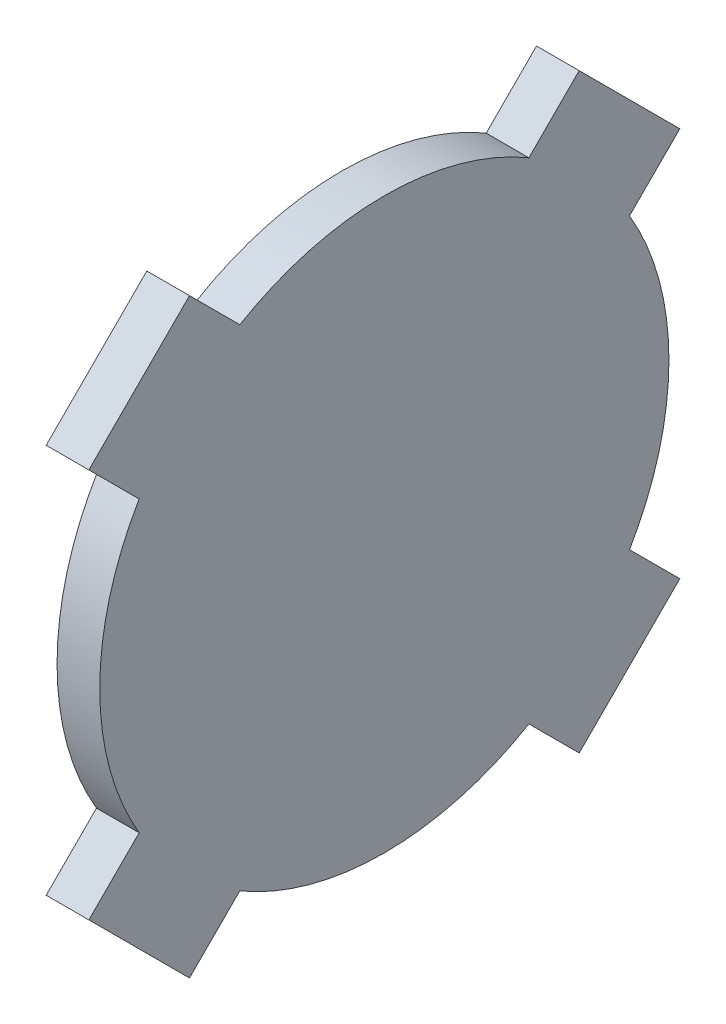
ISO-10303-21;
HEADER;
FILE_DESCRIPTION(('STEP AP214'),'2;1');
FILE_NAME('part.step','',(''),(''),'','','');
FILE_SCHEMA(('AUTOMOTIVE_DESIGN { 1 0 10303 214 1 1 1 1 }'));
ENDSEC;
DATA;
#1=APPLICATION_CONTEXT('core data for automotive mechanical design processes');
#2=APPLICATION_PROTOCOL_DEFINITION('international standard','automotive_design',2000,#1);
#3=PRODUCT_CONTEXT('',#1,'mechanical');
#4=PRODUCT('Part','Part','',(#3));
#5=PRODUCT_RELATED_PRODUCT_CATEGORY('part','',(#4));
#6=PRODUCT_DEFINITION_FORMATION('','',#4);
#7=PRODUCT_DEFINITION_CONTEXT('part definition',#1,'design');
#8=PRODUCT_DEFINITION('design','',#6,#7);
#9=PRODUCT_DEFINITION_SHAPE('','',#8);
#10=(LENGTH_UNIT() NAMED_UNIT(*) SI_UNIT(.MILLI.,.METRE.));
#11=(NAMED_UNIT(*) PLANE_ANGLE_UNIT() SI_UNIT($,.RADIAN.));
#12=(NAMED_UNIT(*) SI_UNIT($,.STERADIAN.) SOLID_ANGLE_UNIT());
#13=UNCERTAINTY_MEASURE_WITH_UNIT(LENGTH_MEASURE(1.E-05),#10,'distance_accuracy_value','');
#14=(GEOMETRIC_REPRESENTATION_CONTEXT(3) GLOBAL_UNCERTAINTY_ASSIGNED_CONTEXT((#13)) GLOBAL_UNIT_ASSIGNED_CONTEXT((#10,
#11,#12)) REPRESENTATION_CONTEXT('',''));
#15=CARTESIAN_POINT('',(0.,0.,0.));
#16=DIRECTION('',(0.,0.,1.));
#17=DIRECTION('',(1.,0.,0.));
#18=AXIS2_PLACEMENT_3D('',#15,#16,#17);
#19=CARTESIAN_POINT('',(3.,-16.8442054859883,-51.188331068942));
#20=DIRECTION('',(-1.,0.,0.));
#21=DIRECTION('',(0.,0.,1.));
#22=AXIS2_PLACEMENT_3D('',#19,#20,#21);
#23=CYLINDRICAL_SURFACE('',#22,20.);
#24=CARTESIAN_POINT('',(0.,-16.8442054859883,-51.188331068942));
#25=DIRECTION('',(1.,0.,0.));
#26=DIRECTION('',(0.,0.,-1.));
#27=AXIS2_PLACEMENT_3D('',#24,#25,#26);
#28=CIRCLE('',#27,20.);
#29=CARTESIAN_POINT('',(0.,-27.0017355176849,-68.4169289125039));
#30=VERTEX_POINT('',#29);
#31=CARTESIAN_POINT('',(0.,-6.68667545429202,-68.416928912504));
#32=VERTEX_POINT('',#31);
#33=EDGE_CURVE('E177',#30,#32,#28,.T.);
#34=ORIENTED_EDGE('',*,*,#33,.T.);
#35=DIRECTION('',(-1.,0.,0.));
#36=VECTOR('',#35,1.);
#37=CARTESIAN_POINT('',(3.,-6.68667545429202,-68.416928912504));
#38=LINE('',#37,#36);
#39=CARTESIAN_POINT('',(3.,-6.68667545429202,-68.416928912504));
#40=VERTEX_POINT('',#39);
#41=EDGE_CURVE('E11',#40,#32,#38,.T.);
#42=ORIENTED_EDGE('',*,*,#41,.F.);
#43=CARTESIAN_POINT('',(3.,-16.8442054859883,-51.188331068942));
#44=DIRECTION('',(1.,0.,0.));
#45=DIRECTION('',(0.,0.,-1.));
#46=AXIS2_PLACEMENT_3D('',#43,#44,#45);
#47=CIRCLE('',#46,20.);
#48=CARTESIAN_POINT('',(3.,-27.0017355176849,-68.4169289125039));
#49=VERTEX_POINT('',#48);
#50=EDGE_CURVE('E207',#49,#40,#47,.T.);
#51=ORIENTED_EDGE('',*,*,#50,.F.);
#52=DIRECTION('',(-1.,0.,0.));
#53=VECTOR('',#52,1.);
#54=CARTESIAN_POINT('',(3.,-27.0017355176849,-68.4169289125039));
#55=LINE('',#54,#53);
#56=EDGE_CURVE('E173',#49,#30,#55,.T.);
#57=ORIENTED_EDGE('',*,*,#56,.T.);
#58=EDGE_LOOP('',(#34,#42,#51,#57));
#59=FACE_BOUND('',#58,.T.);
#60=ADVANCED_FACE('F33',(#59),#23,.T.);
#61=CARTESIAN_POINT('',(3.,-6.68667545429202,-68.416928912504));
#62=DIRECTION('',(0.,0.707106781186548,0.707106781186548));
#63=DIRECTION('',(0.,-0.707106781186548,0.707106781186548));
#64=AXIS2_PLACEMENT_3D('',#61,#62,#63);
#65=PLANE('',#64);
#66=DIRECTION('',(0.,0.707106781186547,-0.707106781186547));
#67=VECTOR('',#66,1.);
#68=CARTESIAN_POINT('',(0.,-6.68667545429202,-68.416928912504));
#69=LINE('',#68,#67);
#70=CARTESIAN_POINT('',(0.,-3.15114154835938,-71.9524628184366));
#71=VERTEX_POINT('',#70);
#72=EDGE_CURVE('E180',#32,#71,#69,.T.);
#73=ORIENTED_EDGE('',*,*,#72,.T.);
#74=DIRECTION('',(-1.,0.,0.));
#75=VECTOR('',#74,1.);
#76=CARTESIAN_POINT('',(3.,-3.15114154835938,-71.9524628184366));
#77=LINE('',#76,#75);
#78=CARTESIAN_POINT('',(3.,-3.15114154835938,-71.9524628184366));
#79=VERTEX_POINT('',#78);
#80=EDGE_CURVE('E41',#79,#71,#77,.T.);
#81=ORIENTED_EDGE('',*,*,#80,.F.);
#82=DIRECTION('',(0.,0.707106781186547,-0.707106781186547));
#83=VECTOR('',#82,1.);
#84=CARTESIAN_POINT('',(3.,-6.68667545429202,-68.416928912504));
#85=LINE('',#84,#83);
#86=EDGE_CURVE('E116',#40,#79,#85,.T.);
#87=ORIENTED_EDGE('',*,*,#86,.F.);
#88=ORIENTED_EDGE('',*,*,#41,.T.);
#89=EDGE_LOOP('',(#73,#81,#87,#88));
#90=FACE_BOUND('',#89,.T.);
#91=ADVANCED_FACE('F305',(#90),#65,.F.);
#92=CARTESIAN_POINT('',(3.,3.91992626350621,-64.8813950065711));
#93=DIRECTION('',(0.,-0.707106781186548,0.707106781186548));
#94=DIRECTION('',(0.,-0.707106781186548,-0.707106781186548));
#95=AXIS2_PLACEMENT_3D('',#92,#93,#94);
#96=PLANE('',#95);
#97=DIRECTION('',(0.,0.707106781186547,0.707106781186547));
#98=VECTOR('',#97,1.);
#99=CARTESIAN_POINT('',(0.,3.91992626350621,-64.8813950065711));
#100=LINE('',#99,#98);
#101=CARTESIAN_POINT('',(0.,3.91992626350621,-64.8813950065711));
#102=VERTEX_POINT('',#101);
#103=EDGE_CURVE('E182',#71,#102,#100,.T.);
#104=ORIENTED_EDGE('',*,*,#103,.T.);
#105=DIRECTION('',(-1.,0.,0.));
#106=VECTOR('',#105,1.);
#107=CARTESIAN_POINT('',(3.,3.91992626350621,-64.8813950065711));
#108=LINE('',#107,#106);
#109=CARTESIAN_POINT('',(3.,3.91992626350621,-64.8813950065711));
#110=VERTEX_POINT('',#109);
#111=EDGE_CURVE('E238',#110,#102,#108,.T.);
#112=ORIENTED_EDGE('',*,*,#111,.F.);
#113=DIRECTION('',(0.,0.707106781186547,0.707106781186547));
#114=VECTOR('',#113,1.);
#115=CARTESIAN_POINT('',(3.,3.91992626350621,-64.8813950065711));
#116=LINE('',#115,#114);
#117=EDGE_CURVE('E246',#79,#110,#116,.T.);
#118=ORIENTED_EDGE('',*,*,#117,.F.);
#119=ORIENTED_EDGE('',*,*,#80,.T.);
#120=EDGE_LOOP('',(#104,#112,#118,#119));
#121=FACE_BOUND('',#120,.T.);
#122=ADVANCED_FACE('F244',(#121),#96,.F.);
#123=CARTESIAN_POINT('',(3.,3.91992626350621,-64.8813950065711));
#124=DIRECTION('',(0.,-0.707106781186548,-0.707106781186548));
#125=DIRECTION('',(0.,0.707106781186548,-0.707106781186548));
#126=AXIS2_PLACEMENT_3D('',#123,#124,#125);
#127=PLANE('',#126);
#128=DIRECTION('',(0.,-0.707106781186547,0.707106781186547));
#129=VECTOR('',#128,1.);
#130=CARTESIAN_POINT('',(0.,3.91992626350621,-64.8813950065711));
#131=LINE('',#130,#129);
#132=CARTESIAN_POINT('',(0.,0.384392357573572,-61.3458611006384));
#133=VERTEX_POINT('',#132);
#134=EDGE_CURVE('E184',#102,#133,#131,.T.);
#135=ORIENTED_EDGE('',*,*,#134,.T.);
#136=DIRECTION('',(-1.,0.,0.));
#137=VECTOR('',#136,1.);
#138=CARTESIAN_POINT('',(3.,0.384392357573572,-61.3458611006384));
#139=LINE('',#138,#137);
#140=CARTESIAN_POINT('',(3.,0.384392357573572,-61.3458611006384));
#141=VERTEX_POINT('',#140);
#142=EDGE_CURVE('E235',#141,#133,#139,.T.);
#143=ORIENTED_EDGE('',*,*,#142,.F.);
#144=DIRECTION('',(0.,-0.707106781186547,0.707106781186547));
#145=VECTOR('',#144,1.);
#146=CARTESIAN_POINT('',(3.,3.91992626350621,-64.8813950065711));
#147=LINE('',#146,#145);
#148=EDGE_CURVE('E264',#110,#141,#147,.T.);
#149=ORIENTED_EDGE('',*,*,#148,.F.);
#150=ORIENTED_EDGE('',*,*,#111,.T.);
#151=EDGE_LOOP('',(#135,#143,#149,#150));
#152=FACE_BOUND('',#151,.T.);
#153=ADVANCED_FACE('F255',(#152),#127,.F.);
#154=CARTESIAN_POINT('',(3.,-16.8442054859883,-51.188331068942));
#155=DIRECTION('',(-1.,0.,0.));
#156=DIRECTION('',(0.,0.,1.));
#157=AXIS2_PLACEMENT_3D('',#154,#155,#156);
#158=CYLINDRICAL_SURFACE('',#157,20.);
#159=CARTESIAN_POINT('',(0.,-16.8442054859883,-51.188331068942));
#160=DIRECTION('',(1.,0.,0.));
#161=DIRECTION('',(0.,0.,-1.));
#162=AXIS2_PLACEMENT_3D('',#159,#160,#161);
#163=CIRCLE('',#162,20.);
#164=CARTESIAN_POINT('',(0.,0.384392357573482,-41.0308010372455));
#165=VERTEX_POINT('',#164);
#166=EDGE_CURVE('E186',#133,#165,#163,.T.);
#167=ORIENTED_EDGE('',*,*,#166,.T.);
#168=DIRECTION('',(-1.,0.,0.));
#169=VECTOR('',#168,1.);
#170=CARTESIAN_POINT('',(3.,0.384392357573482,-41.0308010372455));
#171=LINE('',#170,#169);
#172=CARTESIAN_POINT('',(3.,0.384392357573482,-41.0308010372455));
#173=VERTEX_POINT('',#172);
#174=EDGE_CURVE('E232',#173,#165,#171,.T.);
#175=ORIENTED_EDGE('',*,*,#174,.F.);
#176=CARTESIAN_POINT('',(3.,-16.8442054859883,-51.188331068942));
#177=DIRECTION('',(1.,0.,0.));
#178=DIRECTION('',(0.,0.,-1.));
#179=AXIS2_PLACEMENT_3D('',#176,#177,#178);
#180=CIRCLE('',#179,20.);
#181=EDGE_CURVE('E261',#141,#173,#180,.T.);
#182=ORIENTED_EDGE('',*,*,#181,.F.);
#183=ORIENTED_EDGE('',*,*,#142,.T.);
#184=EDGE_LOOP('',(#167,#175,#182,#183));
#185=FACE_BOUND('',#184,.T.);
#186=ADVANCED_FACE('F259',(#185),#158,.T.);
#187=CARTESIAN_POINT('',(3.,0.384392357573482,-41.0308010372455));
#188=DIRECTION('',(0.,-0.707106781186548,0.707106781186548));
#189=DIRECTION('',(0.,-0.707106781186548,-0.707106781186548));
#190=AXIS2_PLACEMENT_3D('',#187,#188,#189);
#191=PLANE('',#190);
#192=DIRECTION('',(0.,0.707106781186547,0.707106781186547));
#193=VECTOR('',#192,1.);
#194=CARTESIAN_POINT('',(0.,0.384392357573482,-41.0308010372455));
#195=LINE('',#194,#193);
#196=CARTESIAN_POINT('',(0.,3.91992626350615,-37.4952671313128));
#197=VERTEX_POINT('',#196);
#198=EDGE_CURVE('E188',#165,#197,#195,.T.);
#199=ORIENTED_EDGE('',*,*,#198,.T.);
#200=DIRECTION('',(-1.,0.,0.));
#201=VECTOR('',#200,1.);
#202=CARTESIAN_POINT('',(3.,3.91992626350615,-37.4952671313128));
#203=LINE('',#202,#201);
#204=CARTESIAN_POINT('',(3.,3.91992626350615,-37.4952671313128));
#205=VERTEX_POINT('',#204);
#206=EDGE_CURVE('E229',#205,#197,#203,.T.);
#207=ORIENTED_EDGE('',*,*,#206,.F.);
#208=DIRECTION('',(0.,0.707106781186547,0.707106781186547));
#209=VECTOR('',#208,1.);
#210=CARTESIAN_POINT('',(3.,0.384392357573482,-41.0308010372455));
#211=LINE('',#210,#209);
#212=EDGE_CURVE('E263',#173,#205,#211,.T.);
#213=ORIENTED_EDGE('',*,*,#212,.F.);
#214=ORIENTED_EDGE('',*,*,#174,.T.);
#215=EDGE_LOOP('',(#199,#207,#213,#214));
#216=FACE_BOUND('',#215,.T.);
#217=ADVANCED_FACE('F318',(#216),#191,.F.);
#218=CARTESIAN_POINT('',(3.,-3.15114154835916,-30.4241993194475));
#219=DIRECTION('',(0.,-0.707106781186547,-0.707106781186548));
#220=DIRECTION('',(0.,0.707106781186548,-0.707106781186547));
#221=AXIS2_PLACEMENT_3D('',#218,#219,#220);
#222=PLANE('',#221);
#223=DIRECTION('',(0.,-0.707106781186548,0.707106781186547));
#224=VECTOR('',#223,1.);
#225=CARTESIAN_POINT('',(0.,-3.15114154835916,-30.4241993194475));
#226=LINE('',#225,#224);
#227=CARTESIAN_POINT('',(0.,-3.15114154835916,-30.4241993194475));
#228=VERTEX_POINT('',#227);
#229=EDGE_CURVE('E190',#197,#228,#226,.T.);
#230=ORIENTED_EDGE('',*,*,#229,.T.);
#231=DIRECTION('',(-1.,0.,0.));
#232=VECTOR('',#231,1.);
#233=CARTESIAN_POINT('',(3.,-3.15114154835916,-30.4241993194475));
#234=LINE('',#233,#232);
#235=CARTESIAN_POINT('',(3.,-3.15114154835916,-30.4241993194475));
#236=VERTEX_POINT('',#235);
#237=EDGE_CURVE('E226',#236,#228,#234,.T.);
#238=ORIENTED_EDGE('',*,*,#237,.F.);
#239=DIRECTION('',(0.,-0.707106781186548,0.707106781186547));
#240=VECTOR('',#239,1.);
#241=CARTESIAN_POINT('',(3.,-3.15114154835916,-30.4241993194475));
#242=LINE('',#241,#240);
#243=EDGE_CURVE('E266',#205,#236,#242,.T.);
#244=ORIENTED_EDGE('',*,*,#243,.F.);
#245=ORIENTED_EDGE('',*,*,#206,.T.);
#246=EDGE_LOOP('',(#230,#238,#244,#245));
#247=FACE_BOUND('',#246,.T.);
#248=ADVANCED_FACE('F321',(#247),#222,.F.);
#249=CARTESIAN_POINT('',(3.,-3.15114154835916,-30.4241993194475));
#250=DIRECTION('',(0.,0.707106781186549,-0.707106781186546));
#251=DIRECTION('',(0.,0.707106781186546,0.707106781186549));
#252=AXIS2_PLACEMENT_3D('',#249,#250,#251);
#253=PLANE('',#252);
#254=DIRECTION('',(0.,-0.707106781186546,-0.707106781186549));
#255=VECTOR('',#254,1.);
#256=CARTESIAN_POINT('',(0.,-3.15114154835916,-30.4241993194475));
#257=LINE('',#256,#255);
#258=CARTESIAN_POINT('',(0.,-6.68667545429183,-33.9597332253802));
#259=VERTEX_POINT('',#258);
#260=EDGE_CURVE('E192',#228,#259,#257,.T.);
#261=ORIENTED_EDGE('',*,*,#260,.T.);
#262=DIRECTION('',(-1.,0.,0.));
#263=VECTOR('',#262,1.);
#264=CARTESIAN_POINT('',(3.,-6.68667545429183,-33.9597332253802));
#265=LINE('',#264,#263);
#266=CARTESIAN_POINT('',(3.,-6.68667545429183,-33.9597332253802));
#267=VERTEX_POINT('',#266);
#268=EDGE_CURVE('E223',#267,#259,#265,.T.);
#269=ORIENTED_EDGE('',*,*,#268,.F.);
#270=DIRECTION('',(0.,-0.707106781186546,-0.707106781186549));
#271=VECTOR('',#270,1.);
#272=CARTESIAN_POINT('',(3.,-3.15114154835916,-30.4241993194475));
#273=LINE('',#272,#271);
#274=EDGE_CURVE('E272',#236,#267,#273,.T.);
#275=ORIENTED_EDGE('',*,*,#274,.F.);
#276=ORIENTED_EDGE('',*,*,#237,.T.);
#277=EDGE_LOOP('',(#261,#269,#275,#276));
#278=FACE_BOUND('',#277,.T.);
#279=ADVANCED_FACE('F325',(#278),#253,.F.);
#280=CARTESIAN_POINT('',(3.,-16.8442054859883,-51.188331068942));
#281=DIRECTION('',(-1.,0.,0.));
#282=DIRECTION('',(0.,0.,1.));
#283=AXIS2_PLACEMENT_3D('',#280,#281,#282);
#284=CYLINDRICAL_SURFACE('',#283,20.);
#285=CARTESIAN_POINT('',(0.,-16.8442054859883,-51.188331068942));
#286=DIRECTION('',(1.,0.,0.));
#287=DIRECTION('',(0.,0.,-1.));
#288=AXIS2_PLACEMENT_3D('',#285,#286,#287);
#289=CIRCLE('',#288,20.);
#290=CARTESIAN_POINT('',(0.,-27.0017355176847,-33.9597332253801));
#291=VERTEX_POINT('',#290);
#292=EDGE_CURVE('E194',#259,#291,#289,.T.);
#293=ORIENTED_EDGE('',*,*,#292,.T.);
#294=DIRECTION('',(-1.,0.,0.));
#295=VECTOR('',#294,1.);
#296=CARTESIAN_POINT('',(3.,-27.0017355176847,-33.9597332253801));
#297=LINE('',#296,#295);
#298=CARTESIAN_POINT('',(3.,-27.0017355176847,-33.9597332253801));
#299=VERTEX_POINT('',#298);
#300=EDGE_CURVE('E220',#299,#291,#297,.T.);
#301=ORIENTED_EDGE('',*,*,#300,.F.);
#302=CARTESIAN_POINT('',(3.,-16.8442054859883,-51.188331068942));
#303=DIRECTION('',(1.,0.,0.));
#304=DIRECTION('',(0.,0.,-1.));
#305=AXIS2_PLACEMENT_3D('',#302,#303,#304);
#306=CIRCLE('',#305,20.);
#307=EDGE_CURVE('E274',#267,#299,#306,.T.);
#308=ORIENTED_EDGE('',*,*,#307,.F.);
#309=ORIENTED_EDGE('',*,*,#268,.T.);
#310=EDGE_LOOP('',(#293,#301,#308,#309));
#311=FACE_BOUND('',#310,.T.);
#312=ADVANCED_FACE('F329',(#311),#284,.T.);
#313=CARTESIAN_POINT('',(3.,-27.0017355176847,-33.9597332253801));
#314=DIRECTION('',(0.,-0.707106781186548,-0.707106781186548));
#315=DIRECTION('',(0.,0.707106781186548,-0.707106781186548));
#316=AXIS2_PLACEMENT_3D('',#313,#314,#315);
#317=PLANE('',#316);
#318=DIRECTION('',(0.,-0.707106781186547,0.707106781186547));
#319=VECTOR('',#318,1.);
#320=CARTESIAN_POINT('',(0.,-27.0017355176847,-33.9597332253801));
#321=LINE('',#320,#319);
#322=CARTESIAN_POINT('',(0.,-30.5372694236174,-30.4241993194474));
#323=VERTEX_POINT('',#322);
#324=EDGE_CURVE('E196',#291,#323,#321,.T.);
#325=ORIENTED_EDGE('',*,*,#324,.T.);
#326=DIRECTION('',(-1.,0.,0.));
#327=VECTOR('',#326,1.);
#328=CARTESIAN_POINT('',(3.,-30.5372694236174,-30.4241993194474));
#329=LINE('',#328,#327);
#330=CARTESIAN_POINT('',(3.,-30.5372694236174,-30.4241993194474));
#331=VERTEX_POINT('',#330);
#332=EDGE_CURVE('E217',#331,#323,#329,.T.);
#333=ORIENTED_EDGE('',*,*,#332,.F.);
#334=DIRECTION('',(0.,-0.707106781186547,0.707106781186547));
#335=VECTOR('',#334,1.);
#336=CARTESIAN_POINT('',(3.,-27.0017355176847,-33.9597332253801));
#337=LINE('',#336,#335);
#338=EDGE_CURVE('E276',#299,#331,#337,.T.);
#339=ORIENTED_EDGE('',*,*,#338,.F.);
#340=ORIENTED_EDGE('',*,*,#300,.T.);
#341=EDGE_LOOP('',(#325,#333,#339,#340));
#342=FACE_BOUND('',#341,.T.);
#343=ADVANCED_FACE('F333',(#342),#317,.F.);
#344=CARTESIAN_POINT('',(3.,-37.608337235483,-37.495267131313));
#345=DIRECTION('',(0.,0.707106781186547,-0.707106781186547));
#346=DIRECTION('',(0.,0.707106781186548,0.707106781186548));
#347=AXIS2_PLACEMENT_3D('',#344,#345,#346);
#348=PLANE('',#347);
#349=DIRECTION('',(0.,-0.707106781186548,-0.707106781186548));
#350=VECTOR('',#349,1.);
#351=CARTESIAN_POINT('',(0.,-37.608337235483,-37.495267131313));
#352=LINE('',#351,#350);
#353=CARTESIAN_POINT('',(0.,-37.608337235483,-37.495267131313));
#354=VERTEX_POINT('',#353);
#355=EDGE_CURVE('E198',#323,#354,#352,.T.);
#356=ORIENTED_EDGE('',*,*,#355,.T.);
#357=DIRECTION('',(-1.,0.,0.));
#358=VECTOR('',#357,1.);
#359=CARTESIAN_POINT('',(3.,-37.608337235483,-37.495267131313));
#360=LINE('',#359,#358);
#361=CARTESIAN_POINT('',(3.,-37.608337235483,-37.495267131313));
#362=VERTEX_POINT('',#361);
#363=EDGE_CURVE('E214',#362,#354,#360,.T.);
#364=ORIENTED_EDGE('',*,*,#363,.F.);
#365=DIRECTION('',(0.,-0.707106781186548,-0.707106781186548));
#366=VECTOR('',#365,1.);
#367=CARTESIAN_POINT('',(3.,-37.608337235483,-37.495267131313));
#368=LINE('',#367,#366);
#369=EDGE_CURVE('E278',#331,#362,#368,.T.);
#370=ORIENTED_EDGE('',*,*,#369,.F.);
#371=ORIENTED_EDGE('',*,*,#332,.T.);
#372=EDGE_LOOP('',(#356,#364,#370,#371));
#373=FACE_BOUND('',#372,.T.);
#374=ADVANCED_FACE('F337',(#373),#348,.F.);
#375=CARTESIAN_POINT('',(3.,-37.608337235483,-37.495267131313));
#376=DIRECTION('',(0.,0.707106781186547,0.707106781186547));
#377=DIRECTION('',(0.,-0.707106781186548,0.707106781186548));
#378=AXIS2_PLACEMENT_3D('',#375,#376,#377);
#379=PLANE('',#378);
#380=DIRECTION('',(0.,0.707106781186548,-0.707106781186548));
#381=VECTOR('',#380,1.);
#382=CARTESIAN_POINT('',(0.,-37.608337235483,-37.495267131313));
#383=LINE('',#382,#381);
#384=CARTESIAN_POINT('',(0.,-34.0728033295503,-41.0308010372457));
#385=VERTEX_POINT('',#384);
#386=EDGE_CURVE('E200',#354,#385,#383,.T.);
#387=ORIENTED_EDGE('',*,*,#386,.T.);
#388=DIRECTION('',(-1.,0.,0.));
#389=VECTOR('',#388,1.);
#390=CARTESIAN_POINT('',(3.,-34.0728033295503,-41.0308010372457));
#391=LINE('',#390,#389);
#392=CARTESIAN_POINT('',(3.,-34.0728033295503,-41.0308010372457));
#393=VERTEX_POINT('',#392);
#394=EDGE_CURVE('E211',#393,#385,#391,.T.);
#395=ORIENTED_EDGE('',*,*,#394,.F.);
#396=DIRECTION('',(0.,0.707106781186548,-0.707106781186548));
#397=VECTOR('',#396,1.);
#398=CARTESIAN_POINT('',(3.,-37.608337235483,-37.495267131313));
#399=LINE('',#398,#397);
#400=EDGE_CURVE('E280',#362,#393,#399,.T.);
#401=ORIENTED_EDGE('',*,*,#400,.F.);
#402=ORIENTED_EDGE('',*,*,#363,.T.);
#403=EDGE_LOOP('',(#387,#395,#401,#402));
#404=FACE_BOUND('',#403,.T.);
#405=ADVANCED_FACE('F286',(#404),#379,.F.);
#406=CARTESIAN_POINT('',(3.,-16.8442054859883,-51.188331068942));
#407=DIRECTION('',(-1.,0.,0.));
#408=DIRECTION('',(0.,0.,1.));
#409=AXIS2_PLACEMENT_3D('',#406,#407,#408);
#410=CYLINDRICAL_SURFACE('',#409,20.);
#411=CARTESIAN_POINT('',(0.,-16.8442054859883,-51.188331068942));
#412=DIRECTION('',(1.,0.,0.));
#413=DIRECTION('',(0.,0.,-1.));
#414=AXIS2_PLACEMENT_3D('',#411,#412,#413);
#415=CIRCLE('',#414,20.);
#416=CARTESIAN_POINT('',(0.,-34.0728033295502,-61.3458611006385));
#417=VERTEX_POINT('',#416);
#418=EDGE_CURVE('E202',#385,#417,#415,.T.);
#419=ORIENTED_EDGE('',*,*,#418,.T.);
#420=DIRECTION('',(-1.,0.,0.));
#421=VECTOR('',#420,1.);
#422=CARTESIAN_POINT('',(3.,-34.0728033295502,-61.3458611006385));
#423=LINE('',#422,#421);
#424=CARTESIAN_POINT('',(3.,-34.0728033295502,-61.3458611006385));
#425=VERTEX_POINT('',#424);
#426=EDGE_CURVE('E168',#425,#417,#423,.T.);
#427=ORIENTED_EDGE('',*,*,#426,.F.);
#428=CARTESIAN_POINT('',(3.,-16.8442054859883,-51.188331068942));
#429=DIRECTION('',(1.,0.,0.));
#430=DIRECTION('',(0.,0.,-1.));
#431=AXIS2_PLACEMENT_3D('',#428,#429,#430);
#432=CIRCLE('',#431,20.);
#433=EDGE_CURVE('E159',#393,#425,#432,.T.);
#434=ORIENTED_EDGE('',*,*,#433,.F.);
#435=ORIENTED_EDGE('',*,*,#394,.T.);
#436=EDGE_LOOP('',(#419,#427,#434,#435));
#437=FACE_BOUND('',#436,.T.);
#438=ADVANCED_FACE('F290',(#437),#410,.T.);
#439=CARTESIAN_POINT('',(3.,-34.0728033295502,-61.3458611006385));
#440=DIRECTION('',(0.,0.707106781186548,-0.707106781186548));
#441=DIRECTION('',(0.,0.707106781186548,0.707106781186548));
#442=AXIS2_PLACEMENT_3D('',#439,#440,#441);
#443=PLANE('',#442);
#444=DIRECTION('',(0.,-0.707106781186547,-0.707106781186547));
#445=VECTOR('',#444,1.);
#446=CARTESIAN_POINT('',(0.,-34.0728033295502,-61.3458611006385));
#447=LINE('',#446,#445);
#448=CARTESIAN_POINT('',(0.,-37.6083372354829,-64.8813950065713));
#449=VERTEX_POINT('',#448);
#450=EDGE_CURVE('E167',#417,#449,#447,.T.);
#451=ORIENTED_EDGE('',*,*,#450,.T.);
#452=DIRECTION('',(-1.,0.,0.));
#453=VECTOR('',#452,1.);
#454=CARTESIAN_POINT('',(3.,-37.6083372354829,-64.8813950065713));
#455=LINE('',#454,#453);
#456=CARTESIAN_POINT('',(3.,-37.6083372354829,-64.8813950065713));
#457=VERTEX_POINT('',#456);
#458=EDGE_CURVE('E164',#457,#449,#455,.T.);
#459=ORIENTED_EDGE('',*,*,#458,.F.);
#460=DIRECTION('',(0.,-0.707106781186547,-0.707106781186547));
#461=VECTOR('',#460,1.);
#462=CARTESIAN_POINT('',(3.,-34.0728033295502,-61.3458611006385));
#463=LINE('',#462,#461);
#464=EDGE_CURVE('E153',#425,#457,#463,.T.);
#465=ORIENTED_EDGE('',*,*,#464,.F.);
#466=ORIENTED_EDGE('',*,*,#426,.T.);
#467=EDGE_LOOP('',(#451,#459,#465,#466));
#468=FACE_BOUND('',#467,.T.);
#469=ADVANCED_FACE('F165',(#468),#443,.F.);
#470=CARTESIAN_POINT('',(3.,-30.5372694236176,-71.9524628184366));
#471=DIRECTION('',(0.,0.707106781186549,0.707106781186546));
#472=DIRECTION('',(0.,-0.707106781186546,0.707106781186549));
#473=AXIS2_PLACEMENT_3D('',#470,#471,#472);
#474=PLANE('',#473);
#475=DIRECTION('',(0.,0.707106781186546,-0.707106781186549));
#476=VECTOR('',#475,1.);
#477=CARTESIAN_POINT('',(0.,-30.5372694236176,-71.9524628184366));
#478=LINE('',#477,#476);
#479=CARTESIAN_POINT('',(0.,-30.5372694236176,-71.9524628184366));
#480=VERTEX_POINT('',#479);
#481=EDGE_CURVE('E102',#449,#480,#478,.T.);
#482=ORIENTED_EDGE('',*,*,#481,.T.);
#483=DIRECTION('',(-1.,0.,0.));
#484=VECTOR('',#483,1.);
#485=CARTESIAN_POINT('',(3.,-30.5372694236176,-71.9524628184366));
#486=LINE('',#485,#484);
#487=CARTESIAN_POINT('',(3.,-30.5372694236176,-71.9524628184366));
#488=VERTEX_POINT('',#487);
#489=EDGE_CURVE('E169',#488,#480,#486,.T.);
#490=ORIENTED_EDGE('',*,*,#489,.F.);
#491=DIRECTION('',(0.,0.707106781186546,-0.707106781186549));
#492=VECTOR('',#491,1.);
#493=CARTESIAN_POINT('',(3.,-30.5372694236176,-71.9524628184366));
#494=LINE('',#493,#492);
#495=EDGE_CURVE('E157',#457,#488,#494,.T.);
#496=ORIENTED_EDGE('',*,*,#495,.F.);
#497=ORIENTED_EDGE('',*,*,#458,.T.);
#498=EDGE_LOOP('',(#482,#490,#496,#497));
#499=FACE_BOUND('',#498,.T.);
#500=ADVANCED_FACE('F171',(#499),#474,.F.);
#501=CARTESIAN_POINT('',(3.,-30.5372694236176,-71.9524628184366));
#502=DIRECTION('',(0.,-0.707106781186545,0.70710678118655));
#503=DIRECTION('',(0.,-0.70710678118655,-0.707106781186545));
#504=AXIS2_PLACEMENT_3D('',#501,#502,#503);
#505=PLANE('',#504);
#506=DIRECTION('',(0.,0.70710678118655,0.707106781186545));
#507=VECTOR('',#506,1.);
#508=CARTESIAN_POINT('',(0.,-30.5372694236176,-71.9524628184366));
#509=LINE('',#508,#507);
#510=EDGE_CURVE('E108',#480,#30,#509,.T.);
#511=ORIENTED_EDGE('',*,*,#510,.T.);
#512=ORIENTED_EDGE('',*,*,#56,.F.);
#513=DIRECTION('',(0.,0.70710678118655,0.707106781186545));
#514=VECTOR('',#513,1.);
#515=CARTESIAN_POINT('',(3.,-30.5372694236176,-71.9524628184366));
#516=LINE('',#515,#514);
#517=EDGE_CURVE('E49',#488,#49,#516,.T.);
#518=ORIENTED_EDGE('',*,*,#517,.F.);
#519=ORIENTED_EDGE('',*,*,#489,.T.);
#520=EDGE_LOOP('',(#511,#512,#518,#519));
#521=FACE_BOUND('',#520,.T.);
#522=ADVANCED_FACE('F294',(#521),#505,.F.);
#523=CARTESIAN_POINT('',(3.,-16.8442054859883,-51.188331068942));
#524=DIRECTION('',(1.,0.,0.));
#525=DIRECTION('',(0.,0.,-1.));
#526=AXIS2_PLACEMENT_3D('',#523,#524,#525);
#527=PLANE('',#526);
#528=ORIENTED_EDGE('',*,*,#50,.T.);
#529=ORIENTED_EDGE('',*,*,#86,.T.);
#530=ORIENTED_EDGE('',*,*,#117,.T.);
#531=ORIENTED_EDGE('',*,*,#148,.T.);
#532=ORIENTED_EDGE('',*,*,#181,.T.);
#533=ORIENTED_EDGE('',*,*,#212,.T.);
#534=ORIENTED_EDGE('',*,*,#243,.T.);
#535=ORIENTED_EDGE('',*,*,#274,.T.);
#536=ORIENTED_EDGE('',*,*,#307,.T.);
#537=ORIENTED_EDGE('',*,*,#338,.T.);
#538=ORIENTED_EDGE('',*,*,#369,.T.);
#539=ORIENTED_EDGE('',*,*,#400,.T.);
#540=ORIENTED_EDGE('',*,*,#433,.T.);
#541=ORIENTED_EDGE('',*,*,#464,.T.);
#542=ORIENTED_EDGE('',*,*,#495,.T.);
#543=ORIENTED_EDGE('',*,*,#517,.T.);
#544=EDGE_LOOP('',(#528,#529,#530,#531,#532,#533,#534,#535,#536,#537,#538,#539,#540,#541,#542,#543));
#545=FACE_BOUND('',#544,.T.);
#546=ADVANCED_FACE('F155',(#545),#527,.T.);
#547=CARTESIAN_POINT('',(0.,-16.8442054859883,-51.188331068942));
#548=DIRECTION('',(1.,0.,0.));
#549=DIRECTION('',(0.,0.,-1.));
#550=AXIS2_PLACEMENT_3D('',#547,#548,#549);
#551=PLANE('',#550);
#552=ORIENTED_EDGE('',*,*,#33,.F.);
#553=ORIENTED_EDGE('',*,*,#510,.F.);
#554=ORIENTED_EDGE('',*,*,#481,.F.);
#555=ORIENTED_EDGE('',*,*,#450,.F.);
#556=ORIENTED_EDGE('',*,*,#418,.F.);
#557=ORIENTED_EDGE('',*,*,#386,.F.);
#558=ORIENTED_EDGE('',*,*,#355,.F.);
#559=ORIENTED_EDGE('',*,*,#324,.F.);
#560=ORIENTED_EDGE('',*,*,#292,.F.);
#561=ORIENTED_EDGE('',*,*,#260,.F.);
#562=ORIENTED_EDGE('',*,*,#229,.F.);
#563=ORIENTED_EDGE('',*,*,#198,.F.);
#564=ORIENTED_EDGE('',*,*,#166,.F.);
#565=ORIENTED_EDGE('',*,*,#134,.F.);
#566=ORIENTED_EDGE('',*,*,#103,.F.);
#567=ORIENTED_EDGE('',*,*,#72,.F.);
#568=EDGE_LOOP('',(#552,#553,#554,#555,#556,#557,#558,#559,#560,#561,#562,#563,#564,#565,#566,#567));
#569=FACE_BOUND('',#568,.T.);
#570=ADVANCED_FACE('F250',(#569),#551,.F.);
#571=CLOSED_SHELL('',(#60,#91,#122,#153,#186,#217,#248,#279,#312,#343,#374,#405,#438,#469,#500,
#522,#546,#570));
#572=MANIFOLD_SOLID_BREP('B2',#571);
#573=ADVANCED_BREP_SHAPE_REPRESENTATION('',(#18,#572),#14);
#574=SHAPE_DEFINITION_REPRESENTATION(#9,#573);
ENDSEC;
END-ISO-10303-21;
